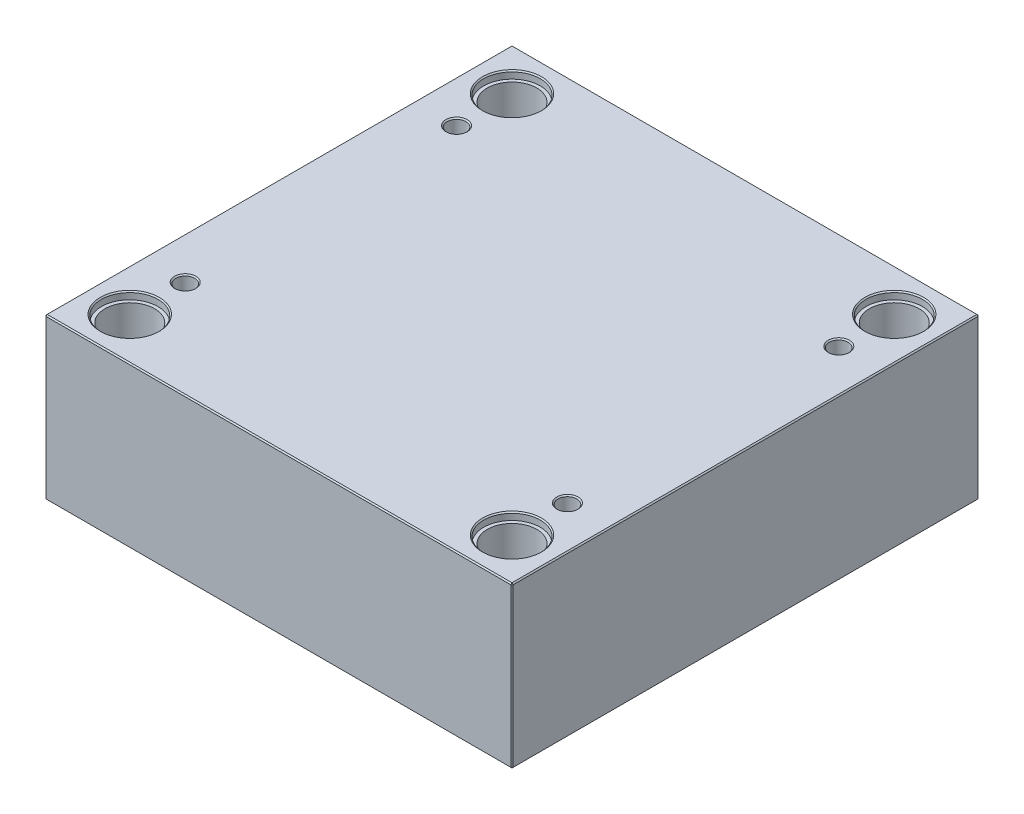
ISO-10303-21;
HEADER;
FILE_DESCRIPTION(('STEP AP214'),'2;1');
FILE_NAME('part.step','',(''),(''),'','','');
FILE_SCHEMA(('AUTOMOTIVE_DESIGN { 1 0 10303 214 1 1 1 1 }'));
ENDSEC;
DATA;
#1=APPLICATION_CONTEXT('core data for automotive mechanical design processes');
#2=APPLICATION_PROTOCOL_DEFINITION('international standard','automotive_design',2000,#1);
#3=PRODUCT_CONTEXT('',#1,'mechanical');
#4=PRODUCT('Part','Part','',(#3));
#5=PRODUCT_RELATED_PRODUCT_CATEGORY('part','',(#4));
#6=PRODUCT_DEFINITION_FORMATION('','',#4);
#7=PRODUCT_DEFINITION_CONTEXT('part definition',#1,'design');
#8=PRODUCT_DEFINITION('design','',#6,#7);
#9=PRODUCT_DEFINITION_SHAPE('','',#8);
#10=(LENGTH_UNIT() NAMED_UNIT(*) SI_UNIT(.MILLI.,.METRE.));
#11=(NAMED_UNIT(*) PLANE_ANGLE_UNIT() SI_UNIT($,.RADIAN.));
#12=(NAMED_UNIT(*) SI_UNIT($,.STERADIAN.) SOLID_ANGLE_UNIT());
#13=UNCERTAINTY_MEASURE_WITH_UNIT(LENGTH_MEASURE(1.E-05),#10,'distance_accuracy_value','');
#14=(GEOMETRIC_REPRESENTATION_CONTEXT(3) GLOBAL_UNCERTAINTY_ASSIGNED_CONTEXT((#13)) GLOBAL_UNIT_ASSIGNED_CONTEXT((#10,
#11,#12)) REPRESENTATION_CONTEXT('',''));
#15=CARTESIAN_POINT('',(0.,0.,0.));
#16=DIRECTION('',(0.,0.,1.));
#17=DIRECTION('',(1.,0.,0.));
#18=AXIS2_PLACEMENT_3D('',#15,#16,#17);
#19=CARTESIAN_POINT('',(-162.,0.,-162.));
#20=DIRECTION('',(0.,1.,0.));
#21=DIRECTION('',(0.,0.,1.));
#22=AXIS2_PLACEMENT_3D('',#19,#20,#21);
#23=CYLINDRICAL_SURFACE('',#22,21.);
#24=CARTESIAN_POINT('',(-162.,0.999999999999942,-162.));
#25=DIRECTION('',(0.,1.,0.));
#26=DIRECTION('',(0.,0.,1.));
#27=AXIS2_PLACEMENT_3D('',#24,#25,#26);
#28=CIRCLE('',#27,21.);
#29=CARTESIAN_POINT('',(-162.,0.999999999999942,-141.));
#30=VERTEX_POINT('',#29);
#31=EDGE_CURVE('E472',#30,#30,#28,.F.);
#32=ORIENTED_EDGE('',*,*,#31,.T.);
#33=EDGE_LOOP('',(#32));
#34=FACE_BOUND('',#33,.T.);
#35=CARTESIAN_POINT('',(-162.,129.7,-162.));
#36=DIRECTION('',(0.,1.,0.));
#37=DIRECTION('',(0.,0.,1.));
#38=AXIS2_PLACEMENT_3D('',#35,#36,#37);
#39=CIRCLE('',#38,21.);
#40=CARTESIAN_POINT('',(-162.,129.7,-141.));
#41=VERTEX_POINT('',#40);
#42=EDGE_CURVE('E221',#41,#41,#39,.F.);
#43=ORIENTED_EDGE('',*,*,#42,.F.);
#44=EDGE_LOOP('',(#43));
#45=FACE_BOUND('',#44,.T.);
#46=ADVANCED_FACE('F16',(#34,#45),#23,.F.);
#47=CARTESIAN_POINT('',(162.,0.,-162.));
#48=DIRECTION('',(0.,1.,0.));
#49=DIRECTION('',(0.,0.,1.));
#50=AXIS2_PLACEMENT_3D('',#47,#48,#49);
#51=CYLINDRICAL_SURFACE('',#50,21.);
#52=CARTESIAN_POINT('',(162.,0.999999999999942,-162.));
#53=DIRECTION('',(0.,1.,0.));
#54=DIRECTION('',(0.,0.,1.));
#55=AXIS2_PLACEMENT_3D('',#52,#53,#54);
#56=CIRCLE('',#55,21.);
#57=CARTESIAN_POINT('',(162.,0.999999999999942,-141.));
#58=VERTEX_POINT('',#57);
#59=EDGE_CURVE('E474',#58,#58,#56,.F.);
#60=ORIENTED_EDGE('',*,*,#59,.T.);
#61=EDGE_LOOP('',(#60));
#62=FACE_BOUND('',#61,.T.);
#63=CARTESIAN_POINT('',(162.,129.7,-162.));
#64=DIRECTION('',(0.,1.,0.));
#65=DIRECTION('',(0.,0.,1.));
#66=AXIS2_PLACEMENT_3D('',#63,#64,#65);
#67=CIRCLE('',#66,21.);
#68=CARTESIAN_POINT('',(162.,129.7,-141.));
#69=VERTEX_POINT('',#68);
#70=EDGE_CURVE('E218',#69,#69,#67,.F.);
#71=ORIENTED_EDGE('',*,*,#70,.F.);
#72=EDGE_LOOP('',(#71));
#73=FACE_BOUND('',#72,.T.);
#74=ADVANCED_FACE('F263',(#62,#73),#51,.F.);
#75=CARTESIAN_POINT('',(162.,0.,162.));
#76=DIRECTION('',(0.,1.,0.));
#77=DIRECTION('',(0.,0.,1.));
#78=AXIS2_PLACEMENT_3D('',#75,#76,#77);
#79=CYLINDRICAL_SURFACE('',#78,21.);
#80=CARTESIAN_POINT('',(162.,0.999999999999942,162.));
#81=DIRECTION('',(0.,1.,0.));
#82=DIRECTION('',(0.,0.,1.));
#83=AXIS2_PLACEMENT_3D('',#80,#81,#82);
#84=CIRCLE('',#83,21.);
#85=CARTESIAN_POINT('',(162.,0.999999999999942,183.));
#86=VERTEX_POINT('',#85);
#87=EDGE_CURVE('E477',#86,#86,#84,.F.);
#88=ORIENTED_EDGE('',*,*,#87,.T.);
#89=EDGE_LOOP('',(#88));
#90=FACE_BOUND('',#89,.T.);
#91=CARTESIAN_POINT('',(162.,129.7,162.));
#92=DIRECTION('',(0.,1.,0.));
#93=DIRECTION('',(0.,0.,1.));
#94=AXIS2_PLACEMENT_3D('',#91,#92,#93);
#95=CIRCLE('',#94,21.);
#96=CARTESIAN_POINT('',(162.,129.7,183.));
#97=VERTEX_POINT('',#96);
#98=EDGE_CURVE('E214',#97,#97,#95,.F.);
#99=ORIENTED_EDGE('',*,*,#98,.F.);
#100=EDGE_LOOP('',(#99));
#101=FACE_BOUND('',#100,.T.);
#102=ADVANCED_FACE('F270',(#90,#101),#79,.F.);
#103=CARTESIAN_POINT('',(-162.,0.,162.));
#104=DIRECTION('',(0.,1.,0.));
#105=DIRECTION('',(0.,0.,1.));
#106=AXIS2_PLACEMENT_3D('',#103,#104,#105);
#107=CYLINDRICAL_SURFACE('',#106,21.);
#108=CARTESIAN_POINT('',(-162.,0.999999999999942,162.));
#109=DIRECTION('',(0.,1.,0.));
#110=DIRECTION('',(0.,0.,1.));
#111=AXIS2_PLACEMENT_3D('',#108,#109,#110);
#112=CIRCLE('',#111,21.);
#113=CARTESIAN_POINT('',(-162.,0.999999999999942,183.));
#114=VERTEX_POINT('',#113);
#115=EDGE_CURVE('E480',#114,#114,#112,.F.);
#116=ORIENTED_EDGE('',*,*,#115,.T.);
#117=EDGE_LOOP('',(#116));
#118=FACE_BOUND('',#117,.T.);
#119=CARTESIAN_POINT('',(-162.,129.7,162.));
#120=DIRECTION('',(0.,1.,0.));
#121=DIRECTION('',(0.,0.,1.));
#122=AXIS2_PLACEMENT_3D('',#119,#120,#121);
#123=CIRCLE('',#122,21.);
#124=CARTESIAN_POINT('',(-162.,129.7,183.));
#125=VERTEX_POINT('',#124);
#126=EDGE_CURVE('E211',#125,#125,#123,.F.);
#127=ORIENTED_EDGE('',*,*,#126,.F.);
#128=EDGE_LOOP('',(#127));
#129=FACE_BOUND('',#128,.T.);
#130=ADVANCED_FACE('F277',(#118,#129),#107,.F.);
#131=CARTESIAN_POINT('',(-198.,136.,198.));
#132=DIRECTION('',(1.,0.,0.));
#133=DIRECTION('',(0.,0.,-1.));
#134=AXIS2_PLACEMENT_3D('',#131,#132,#133);
#135=PLANE('',#134);
#136=DIRECTION('',(0.,-1.,0.));
#137=VECTOR('',#136,1.);
#138=CARTESIAN_POINT('',(-198.,136.,-197.));
#139=LINE('',#138,#137);
#140=CARTESIAN_POINT('',(-198.,135.,-197.));
#141=VERTEX_POINT('',#140);
#142=CARTESIAN_POINT('',(-198.,1.,-197.));
#143=VERTEX_POINT('',#142);
#144=EDGE_CURVE('E487',#141,#143,#139,.T.);
#145=ORIENTED_EDGE('',*,*,#144,.T.);
#146=DIRECTION('',(0.,0.,1.));
#147=VECTOR('',#146,1.);
#148=CARTESIAN_POINT('',(-198.,1.,198.));
#149=LINE('',#148,#147);
#150=CARTESIAN_POINT('',(-198.,1.,197.));
#151=VERTEX_POINT('',#150);
#152=EDGE_CURVE('E490',#143,#151,#149,.T.);
#153=ORIENTED_EDGE('',*,*,#152,.T.);
#154=DIRECTION('',(0.,1.,0.));
#155=VECTOR('',#154,1.);
#156=CARTESIAN_POINT('',(-198.,136.,197.));
#157=LINE('',#156,#155);
#158=CARTESIAN_POINT('',(-198.,135.,197.));
#159=VERTEX_POINT('',#158);
#160=EDGE_CURVE('E485',#151,#159,#157,.T.);
#161=ORIENTED_EDGE('',*,*,#160,.T.);
#162=DIRECTION('',(0.,0.,-1.));
#163=VECTOR('',#162,1.);
#164=CARTESIAN_POINT('',(-198.,135.,-198.));
#165=LINE('',#164,#163);
#166=EDGE_CURVE('E483',#159,#141,#165,.T.);
#167=ORIENTED_EDGE('',*,*,#166,.T.);
#168=EDGE_LOOP('',(#145,#153,#161,#167));
#169=FACE_BOUND('',#168,.T.);
#170=ADVANCED_FACE('F298',(#169),#135,.F.);
#171=CARTESIAN_POINT('',(198.,136.,198.));
#172=DIRECTION('',(0.,0.,-1.));
#173=DIRECTION('',(-1.,0.,0.));
#174=AXIS2_PLACEMENT_3D('',#171,#172,#173);
#175=PLANE('',#174);
#176=DIRECTION('',(-1.,0.,0.));
#177=VECTOR('',#176,1.);
#178=CARTESIAN_POINT('',(-198.,135.,198.));
#179=LINE('',#178,#177);
#180=CARTESIAN_POINT('',(197.,135.,198.));
#181=VERTEX_POINT('',#180);
#182=CARTESIAN_POINT('',(-197.,135.,198.));
#183=VERTEX_POINT('',#182);
#184=EDGE_CURVE('E509',#181,#183,#179,.T.);
#185=ORIENTED_EDGE('',*,*,#184,.T.);
#186=DIRECTION('',(0.,-1.,0.));
#187=VECTOR('',#186,1.);
#188=CARTESIAN_POINT('',(-197.,136.,198.));
#189=LINE('',#188,#187);
#190=CARTESIAN_POINT('',(-197.,1.00000000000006,198.));
#191=VERTEX_POINT('',#190);
#192=EDGE_CURVE('E515',#183,#191,#189,.T.);
#193=ORIENTED_EDGE('',*,*,#192,.T.);
#194=DIRECTION('',(1.,0.,0.));
#195=VECTOR('',#194,1.);
#196=CARTESIAN_POINT('',(198.,1.00000000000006,198.));
#197=LINE('',#196,#195);
#198=CARTESIAN_POINT('',(197.,1.00000000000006,198.));
#199=VERTEX_POINT('',#198);
#200=EDGE_CURVE('E513',#191,#199,#197,.T.);
#201=ORIENTED_EDGE('',*,*,#200,.T.);
#202=DIRECTION('',(0.,1.,0.));
#203=VECTOR('',#202,1.);
#204=CARTESIAN_POINT('',(197.,136.,198.));
#205=LINE('',#204,#203);
#206=EDGE_CURVE('E511',#199,#181,#205,.T.);
#207=ORIENTED_EDGE('',*,*,#206,.T.);
#208=EDGE_LOOP('',(#185,#193,#201,#207));
#209=FACE_BOUND('',#208,.T.);
#210=ADVANCED_FACE('F294',(#209),#175,.F.);
#211=CARTESIAN_POINT('',(198.,136.,198.));
#212=DIRECTION('',(-1.,0.,0.));
#213=DIRECTION('',(0.,0.,1.));
#214=AXIS2_PLACEMENT_3D('',#211,#212,#213);
#215=PLANE('',#214);
#216=DIRECTION('',(0.,0.,-1.));
#217=VECTOR('',#216,1.);
#218=CARTESIAN_POINT('',(198.,1.00000000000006,198.));
#219=LINE('',#218,#217);
#220=CARTESIAN_POINT('',(198.,1.00000000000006,197.));
#221=VERTEX_POINT('',#220);
#222=CARTESIAN_POINT('',(198.,1.00000000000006,-197.));
#223=VERTEX_POINT('',#222);
#224=EDGE_CURVE('E504',#221,#223,#219,.T.);
#225=ORIENTED_EDGE('',*,*,#224,.T.);
#226=DIRECTION('',(0.,1.,0.));
#227=VECTOR('',#226,1.);
#228=CARTESIAN_POINT('',(198.,136.,-197.));
#229=LINE('',#228,#227);
#230=CARTESIAN_POINT('',(198.,135.,-197.));
#231=VERTEX_POINT('',#230);
#232=EDGE_CURVE('E506',#223,#231,#229,.T.);
#233=ORIENTED_EDGE('',*,*,#232,.T.);
#234=DIRECTION('',(0.,0.,1.));
#235=VECTOR('',#234,1.);
#236=CARTESIAN_POINT('',(198.,135.,198.));
#237=LINE('',#236,#235);
#238=CARTESIAN_POINT('',(198.,135.,197.));
#239=VERTEX_POINT('',#238);
#240=EDGE_CURVE('E500',#231,#239,#237,.T.);
#241=ORIENTED_EDGE('',*,*,#240,.T.);
#242=DIRECTION('',(0.,-1.,0.));
#243=VECTOR('',#242,1.);
#244=CARTESIAN_POINT('',(198.,136.,197.));
#245=LINE('',#244,#243);
#246=EDGE_CURVE('E502',#239,#221,#245,.T.);
#247=ORIENTED_EDGE('',*,*,#246,.T.);
#248=EDGE_LOOP('',(#225,#233,#241,#247));
#249=FACE_BOUND('',#248,.T.);
#250=ADVANCED_FACE('F290',(#249),#215,.F.);
#251=CARTESIAN_POINT('',(198.,136.,-198.));
#252=DIRECTION('',(0.,0.,1.));
#253=DIRECTION('',(1.,0.,0.));
#254=AXIS2_PLACEMENT_3D('',#251,#252,#253);
#255=PLANE('',#254);
#256=DIRECTION('',(0.,-1.,0.));
#257=VECTOR('',#256,1.);
#258=CARTESIAN_POINT('',(197.,136.,-198.));
#259=LINE('',#258,#257);
#260=CARTESIAN_POINT('',(197.,135.,-198.));
#261=VERTEX_POINT('',#260);
#262=CARTESIAN_POINT('',(197.,1.00000000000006,-198.));
#263=VERTEX_POINT('',#262);
#264=EDGE_CURVE('E494',#261,#263,#259,.T.);
#265=ORIENTED_EDGE('',*,*,#264,.T.);
#266=DIRECTION('',(-1.,0.,0.));
#267=VECTOR('',#266,1.);
#268=CARTESIAN_POINT('',(198.,1.00000000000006,-198.));
#269=LINE('',#268,#267);
#270=CARTESIAN_POINT('',(-197.,1.00000000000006,-198.));
#271=VERTEX_POINT('',#270);
#272=EDGE_CURVE('E138',#263,#271,#269,.T.);
#273=ORIENTED_EDGE('',*,*,#272,.T.);
#274=DIRECTION('',(0.,1.,0.));
#275=VECTOR('',#274,1.);
#276=CARTESIAN_POINT('',(-197.,136.,-198.));
#277=LINE('',#276,#275);
#278=CARTESIAN_POINT('',(-197.,135.,-198.));
#279=VERTEX_POINT('',#278);
#280=EDGE_CURVE('E496',#271,#279,#277,.T.);
#281=ORIENTED_EDGE('',*,*,#280,.T.);
#282=DIRECTION('',(1.,0.,0.));
#283=VECTOR('',#282,1.);
#284=CARTESIAN_POINT('',(198.,135.,-198.));
#285=LINE('',#284,#283);
#286=EDGE_CURVE('E492',#279,#261,#285,.T.);
#287=ORIENTED_EDGE('',*,*,#286,.T.);
#288=EDGE_LOOP('',(#265,#273,#281,#287));
#289=FACE_BOUND('',#288,.T.);
#290=ADVANCED_FACE('F282',(#289),#255,.F.);
#291=CARTESIAN_POINT('',(0.,136.,0.));
#292=DIRECTION('',(0.,1.,0.));
#293=DIRECTION('',(0.,0.,1.));
#294=AXIS2_PLACEMENT_3D('',#291,#292,#293);
#295=PLANE('',#294);
#296=CARTESIAN_POINT('',(162.,136.,162.));
#297=DIRECTION('',(0.,1.,0.));
#298=DIRECTION('',(0.,0.,1.));
#299=AXIS2_PLACEMENT_3D('',#296,#297,#298);
#300=CIRCLE('',#299,25.);
#301=CARTESIAN_POINT('',(162.,136.,187.));
#302=VERTEX_POINT('',#301);
#303=EDGE_CURVE('E236',#302,#302,#300,.F.);
#304=ORIENTED_EDGE('',*,*,#303,.T.);
#305=EDGE_LOOP('',(#304));
#306=FACE_BOUND('',#305,.T.);
#307=CARTESIAN_POINT('',(-162.,136.,162.));
#308=DIRECTION('',(0.,1.,0.));
#309=DIRECTION('',(0.,0.,1.));
#310=AXIS2_PLACEMENT_3D('',#307,#308,#309);
#311=CIRCLE('',#310,25.);
#312=CARTESIAN_POINT('',(-162.,136.,187.));
#313=VERTEX_POINT('',#312);
#314=EDGE_CURVE('E233',#313,#313,#311,.F.);
#315=ORIENTED_EDGE('',*,*,#314,.T.);
#316=EDGE_LOOP('',(#315));
#317=FACE_BOUND('',#316,.T.);
#318=CARTESIAN_POINT('',(162.,136.,-162.));
#319=DIRECTION('',(0.,1.,0.));
#320=DIRECTION('',(0.,0.,1.));
#321=AXIS2_PLACEMENT_3D('',#318,#319,#320);
#322=CIRCLE('',#321,25.);
#323=CARTESIAN_POINT('',(162.,136.,-137.));
#324=VERTEX_POINT('',#323);
#325=EDGE_CURVE('E230',#324,#324,#322,.F.);
#326=ORIENTED_EDGE('',*,*,#325,.T.);
#327=EDGE_LOOP('',(#326));
#328=FACE_BOUND('',#327,.T.);
#329=CARTESIAN_POINT('',(-162.,136.,-162.));
#330=DIRECTION('',(0.,1.,0.));
#331=DIRECTION('',(0.,0.,1.));
#332=AXIS2_PLACEMENT_3D('',#329,#330,#331);
#333=CIRCLE('',#332,25.);
#334=CARTESIAN_POINT('',(-162.,136.,-137.));
#335=VERTEX_POINT('',#334);
#336=EDGE_CURVE('E227',#335,#335,#333,.F.);
#337=ORIENTED_EDGE('',*,*,#336,.T.);
#338=EDGE_LOOP('',(#337));
#339=FACE_BOUND('',#338,.T.);
#340=CARTESIAN_POINT('',(-162.,136.,115.));
#341=DIRECTION('',(0.,1.,0.));
#342=DIRECTION('',(0.,0.,1.));
#343=AXIS2_PLACEMENT_3D('',#340,#341,#342);
#344=CIRCLE('',#343,9.);
#345=CARTESIAN_POINT('',(-162.,136.,124.));
#346=VERTEX_POINT('',#345);
#347=EDGE_CURVE('E198',#346,#346,#344,.F.);
#348=ORIENTED_EDGE('',*,*,#347,.T.);
#349=EDGE_LOOP('',(#348));
#350=FACE_BOUND('',#349,.T.);
#351=CARTESIAN_POINT('',(162.,136.,115.));
#352=DIRECTION('',(0.,1.,0.));
#353=DIRECTION('',(0.,0.,1.));
#354=AXIS2_PLACEMENT_3D('',#351,#352,#353);
#355=CIRCLE('',#354,9.);
#356=CARTESIAN_POINT('',(162.,136.,124.));
#357=VERTEX_POINT('',#356);
#358=EDGE_CURVE('E195',#357,#357,#355,.F.);
#359=ORIENTED_EDGE('',*,*,#358,.T.);
#360=EDGE_LOOP('',(#359));
#361=FACE_BOUND('',#360,.T.);
#362=CARTESIAN_POINT('',(162.,136.,-115.));
#363=DIRECTION('',(0.,1.,0.));
#364=DIRECTION('',(0.,0.,1.));
#365=AXIS2_PLACEMENT_3D('',#362,#363,#364);
#366=CIRCLE('',#365,9.);
#367=CARTESIAN_POINT('',(162.,136.,-106.));
#368=VERTEX_POINT('',#367);
#369=EDGE_CURVE('E192',#368,#368,#366,.F.);
#370=ORIENTED_EDGE('',*,*,#369,.T.);
#371=EDGE_LOOP('',(#370));
#372=FACE_BOUND('',#371,.T.);
#373=CARTESIAN_POINT('',(-162.,136.,-115.));
#374=DIRECTION('',(0.,1.,0.));
#375=DIRECTION('',(0.,0.,1.));
#376=AXIS2_PLACEMENT_3D('',#373,#374,#375);
#377=CIRCLE('',#376,9.);
#378=CARTESIAN_POINT('',(-162.,136.,-106.));
#379=VERTEX_POINT('',#378);
#380=EDGE_CURVE('E188',#379,#379,#377,.F.);
#381=ORIENTED_EDGE('',*,*,#380,.T.);
#382=EDGE_LOOP('',(#381));
#383=FACE_BOUND('',#382,.T.);
#384=DIRECTION('',(0.,0.,-1.));
#385=VECTOR('',#384,1.);
#386=CARTESIAN_POINT('',(197.,136.,-198.));
#387=LINE('',#386,#385);
#388=CARTESIAN_POINT('',(197.,136.,197.));
#389=VERTEX_POINT('',#388);
#390=CARTESIAN_POINT('',(197.,136.,-197.));
#391=VERTEX_POINT('',#390);
#392=EDGE_CURVE('E31',#389,#391,#387,.T.);
#393=ORIENTED_EDGE('',*,*,#392,.T.);
#394=DIRECTION('',(-1.,0.,0.));
#395=VECTOR('',#394,1.);
#396=CARTESIAN_POINT('',(-198.,136.,-197.));
#397=LINE('',#396,#395);
#398=CARTESIAN_POINT('',(-197.,136.,-197.));
#399=VERTEX_POINT('',#398);
#400=EDGE_CURVE('E189',#391,#399,#397,.T.);
#401=ORIENTED_EDGE('',*,*,#400,.T.);
#402=DIRECTION('',(0.,0.,1.));
#403=VECTOR('',#402,1.);
#404=CARTESIAN_POINT('',(-197.,136.,198.));
#405=LINE('',#404,#403);
#406=CARTESIAN_POINT('',(-197.,136.,197.));
#407=VERTEX_POINT('',#406);
#408=EDGE_CURVE('E518',#399,#407,#405,.T.);
#409=ORIENTED_EDGE('',*,*,#408,.T.);
#410=DIRECTION('',(1.,0.,0.));
#411=VECTOR('',#410,1.);
#412=CARTESIAN_POINT('',(198.,136.,197.));
#413=LINE('',#412,#411);
#414=EDGE_CURVE('E36',#407,#389,#413,.T.);
#415=ORIENTED_EDGE('',*,*,#414,.T.);
#416=EDGE_LOOP('',(#393,#401,#409,#415));
#417=FACE_BOUND('',#416,.T.);
#418=ADVANCED_FACE('F279',(#306,#317,#328,#339,#350,#361,#372,#383,#417),#295,.T.);
#419=CARTESIAN_POINT('',(0.,0.,0.));
#420=DIRECTION('',(0.,1.,0.));
#421=DIRECTION('',(0.,0.,1.));
#422=AXIS2_PLACEMENT_3D('',#419,#420,#421);
#423=PLANE('',#422);
#424=CARTESIAN_POINT('',(-162.,0.,-162.));
#425=DIRECTION('',(0.,1.,0.));
#426=DIRECTION('',(0.,0.,1.));
#427=AXIS2_PLACEMENT_3D('',#424,#425,#426);
#428=CIRCLE('',#427,22.);
#429=CARTESIAN_POINT('',(-162.,0.,-140.));
#430=VERTEX_POINT('',#429);
#431=EDGE_CURVE('E469',#430,#430,#428,.T.);
#432=ORIENTED_EDGE('',*,*,#431,.T.);
#433=EDGE_LOOP('',(#432));
#434=FACE_BOUND('',#433,.T.);
#435=CARTESIAN_POINT('',(162.,0.,-162.));
#436=DIRECTION('',(0.,1.,0.));
#437=DIRECTION('',(0.,0.,1.));
#438=AXIS2_PLACEMENT_3D('',#435,#436,#437);
#439=CIRCLE('',#438,22.);
#440=CARTESIAN_POINT('',(162.,0.,-140.));
#441=VERTEX_POINT('',#440);
#442=EDGE_CURVE('E466',#441,#441,#439,.T.);
#443=ORIENTED_EDGE('',*,*,#442,.T.);
#444=EDGE_LOOP('',(#443));
#445=FACE_BOUND('',#444,.T.);
#446=CARTESIAN_POINT('',(162.,0.,162.));
#447=DIRECTION('',(0.,1.,0.));
#448=DIRECTION('',(0.,0.,1.));
#449=AXIS2_PLACEMENT_3D('',#446,#447,#448);
#450=CIRCLE('',#449,22.);
#451=CARTESIAN_POINT('',(162.,0.,184.));
#452=VERTEX_POINT('',#451);
#453=EDGE_CURVE('E463',#452,#452,#450,.T.);
#454=ORIENTED_EDGE('',*,*,#453,.T.);
#455=EDGE_LOOP('',(#454));
#456=FACE_BOUND('',#455,.T.);
#457=CARTESIAN_POINT('',(-162.,0.,162.));
#458=DIRECTION('',(0.,1.,0.));
#459=DIRECTION('',(0.,0.,1.));
#460=AXIS2_PLACEMENT_3D('',#457,#458,#459);
#461=CIRCLE('',#460,22.);
#462=CARTESIAN_POINT('',(-162.,0.,184.));
#463=VERTEX_POINT('',#462);
#464=EDGE_CURVE('E460',#463,#463,#461,.T.);
#465=ORIENTED_EDGE('',*,*,#464,.T.);
#466=EDGE_LOOP('',(#465));
#467=FACE_BOUND('',#466,.T.);
#468=DIRECTION('',(0.,0.,1.));
#469=VECTOR('',#468,1.);
#470=CARTESIAN_POINT('',(197.,0.,0.));
#471=LINE('',#470,#469);
#472=CARTESIAN_POINT('',(197.,0.,-197.));
#473=VERTEX_POINT('',#472);
#474=CARTESIAN_POINT('',(197.,0.,197.));
#475=VERTEX_POINT('',#474);
#476=EDGE_CURVE('E108',#473,#475,#471,.T.);
#477=ORIENTED_EDGE('',*,*,#476,.T.);
#478=DIRECTION('',(-1.,0.,0.));
#479=VECTOR('',#478,1.);
#480=CARTESIAN_POINT('',(0.,0.,197.));
#481=LINE('',#480,#479);
#482=CARTESIAN_POINT('',(-197.,0.,197.));
#483=VERTEX_POINT('',#482);
#484=EDGE_CURVE('E458',#475,#483,#481,.T.);
#485=ORIENTED_EDGE('',*,*,#484,.T.);
#486=DIRECTION('',(0.,0.,-1.));
#487=VECTOR('',#486,1.);
#488=CARTESIAN_POINT('',(-197.,0.,0.));
#489=LINE('',#488,#487);
#490=CARTESIAN_POINT('',(-197.,0.,-197.));
#491=VERTEX_POINT('',#490);
#492=EDGE_CURVE('E110',#483,#491,#489,.T.);
#493=ORIENTED_EDGE('',*,*,#492,.T.);
#494=DIRECTION('',(1.,0.,0.));
#495=VECTOR('',#494,1.);
#496=CARTESIAN_POINT('',(0.,0.,-197.));
#497=LINE('',#496,#495);
#498=EDGE_CURVE('E104',#491,#473,#497,.T.);
#499=ORIENTED_EDGE('',*,*,#498,.T.);
#500=EDGE_LOOP('',(#477,#485,#493,#499));
#501=FACE_BOUND('',#500,.T.);
#502=ADVANCED_FACE('F106',(#434,#445,#456,#467,#501),#423,.F.);
#503=CARTESIAN_POINT('',(-162.,0.,-162.));
#504=DIRECTION('',(0.,-1.,0.));
#505=DIRECTION('',(0.,0.,-1.));
#506=AXIS2_PLACEMENT_3D('',#503,#504,#505);
#507=CONICAL_SURFACE('',#506,22.,0.785398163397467);
#508=ORIENTED_EDGE('',*,*,#31,.F.);
#509=EDGE_LOOP('',(#508));
#510=FACE_BOUND('',#509,.T.);
#511=ORIENTED_EDGE('',*,*,#431,.F.);
#512=EDGE_LOOP('',(#511));
#513=FACE_BOUND('',#512,.T.);
#514=ADVANCED_FACE('F286',(#510,#513),#507,.F.);
#515=CARTESIAN_POINT('',(162.,0.,-162.));
#516=DIRECTION('',(0.,-1.,0.));
#517=DIRECTION('',(0.,0.,-1.));
#518=AXIS2_PLACEMENT_3D('',#515,#516,#517);
#519=CONICAL_SURFACE('',#518,22.,0.785398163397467);
#520=ORIENTED_EDGE('',*,*,#59,.F.);
#521=EDGE_LOOP('',(#520));
#522=FACE_BOUND('',#521,.T.);
#523=ORIENTED_EDGE('',*,*,#442,.F.);
#524=EDGE_LOOP('',(#523));
#525=FACE_BOUND('',#524,.T.);
#526=ADVANCED_FACE('F305',(#522,#525),#519,.F.);
#527=CARTESIAN_POINT('',(162.,0.,162.));
#528=DIRECTION('',(0.,-1.,0.));
#529=DIRECTION('',(0.,0.,-1.));
#530=AXIS2_PLACEMENT_3D('',#527,#528,#529);
#531=CONICAL_SURFACE('',#530,22.,0.785398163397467);
#532=ORIENTED_EDGE('',*,*,#87,.F.);
#533=EDGE_LOOP('',(#532));
#534=FACE_BOUND('',#533,.T.);
#535=ORIENTED_EDGE('',*,*,#453,.F.);
#536=EDGE_LOOP('',(#535));
#537=FACE_BOUND('',#536,.T.);
#538=ADVANCED_FACE('F309',(#534,#537),#531,.F.);
#539=CARTESIAN_POINT('',(-162.,0.,162.));
#540=DIRECTION('',(0.,-1.,0.));
#541=DIRECTION('',(0.,0.,-1.));
#542=AXIS2_PLACEMENT_3D('',#539,#540,#541);
#543=CONICAL_SURFACE('',#542,22.,0.785398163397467);
#544=ORIENTED_EDGE('',*,*,#115,.F.);
#545=EDGE_LOOP('',(#544));
#546=FACE_BOUND('',#545,.T.);
#547=ORIENTED_EDGE('',*,*,#464,.F.);
#548=EDGE_LOOP('',(#547));
#549=FACE_BOUND('',#548,.T.);
#550=ADVANCED_FACE('F313',(#546,#549),#543,.F.);
#551=CARTESIAN_POINT('',(198.,136.,197.));
#552=DIRECTION('',(-0.707106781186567,0.,-0.707106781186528));
#553=DIRECTION('',(0.,-1.,0.));
#554=AXIS2_PLACEMENT_3D('',#551,#552,#553);
#555=PLANE('',#554);
#556=DIRECTION('',(-0.707106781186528,0.,0.707106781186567));
#557=VECTOR('',#556,1.);
#558=CARTESIAN_POINT('',(197.,135.,198.));
#559=LINE('',#558,#557);
#560=EDGE_CURVE('E126',#181,#239,#559,.F.);
#561=ORIENTED_EDGE('',*,*,#560,.F.);
#562=ORIENTED_EDGE('',*,*,#206,.F.);
#563=DIRECTION('',(0.707106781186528,0.,-0.707106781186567));
#564=VECTOR('',#563,1.);
#565=CARTESIAN_POINT('',(197.,1.00000000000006,198.));
#566=LINE('',#565,#564);
#567=EDGE_CURVE('E180',#221,#199,#566,.F.);
#568=ORIENTED_EDGE('',*,*,#567,.F.);
#569=ORIENTED_EDGE('',*,*,#246,.F.);
#570=EDGE_LOOP('',(#561,#562,#568,#569));
#571=FACE_BOUND('',#570,.T.);
#572=ADVANCED_FACE('F317',(#571),#555,.F.);
#573=CARTESIAN_POINT('',(197.,135.,198.));
#574=DIRECTION('',(0.577350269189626,0.577350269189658,0.577350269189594));
#575=DIRECTION('',(-0.707106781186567,0.707106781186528,0.));
#576=AXIS2_PLACEMENT_3D('',#573,#574,#575);
#577=PLANE('',#576);
#578=DIRECTION('',(0.,-0.707106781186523,0.707106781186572));
#579=VECTOR('',#578,1.);
#580=CARTESIAN_POINT('',(197.,135.,198.));
#581=LINE('',#580,#579);
#582=EDGE_CURVE('E175',#181,#389,#581,.F.);
#583=ORIENTED_EDGE('',*,*,#582,.F.);
#584=ORIENTED_EDGE('',*,*,#560,.T.);
#585=DIRECTION('',(-0.707106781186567,0.707106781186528,0.));
#586=VECTOR('',#585,1.);
#587=CARTESIAN_POINT('',(197.5,135.5,197.));
#588=LINE('',#587,#586);
#589=EDGE_CURVE('E177',#389,#239,#588,.F.);
#590=ORIENTED_EDGE('',*,*,#589,.F.);
#591=EDGE_LOOP('',(#583,#584,#590));
#592=FACE_BOUND('',#591,.T.);
#593=ADVANCED_FACE('F385',(#592),#577,.T.);
#594=CARTESIAN_POINT('',(197.,1.00000000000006,198.));
#595=DIRECTION('',(0.577350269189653,-0.577350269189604,0.57735026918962));
#596=DIRECTION('',(0.707106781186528,0.,-0.707106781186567));
#597=AXIS2_PLACEMENT_3D('',#594,#595,#596);
#598=PLANE('',#597);
#599=DIRECTION('',(-0.707106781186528,-0.707106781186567,0.));
#600=VECTOR('',#599,1.);
#601=CARTESIAN_POINT('',(197.5,0.500000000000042,197.));
#602=LINE('',#601,#600);
#603=EDGE_CURVE('E124',#221,#475,#602,.T.);
#604=ORIENTED_EDGE('',*,*,#603,.F.);
#605=ORIENTED_EDGE('',*,*,#567,.T.);
#606=DIRECTION('',(0.,0.707106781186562,0.707106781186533));
#607=VECTOR('',#606,1.);
#608=CARTESIAN_POINT('',(197.,1.00000000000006,198.));
#609=LINE('',#608,#607);
#610=EDGE_CURVE('E172',#475,#199,#609,.T.);
#611=ORIENTED_EDGE('',*,*,#610,.F.);
#612=EDGE_LOOP('',(#604,#605,#611));
#613=FACE_BOUND('',#612,.T.);
#614=ADVANCED_FACE('F381',(#613),#598,.T.);
#615=CARTESIAN_POINT('',(197.,136.,0.));
#616=DIRECTION('',(0.707106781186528,0.707106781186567,0.));
#617=DIRECTION('',(0.,0.,1.));
#618=AXIS2_PLACEMENT_3D('',#615,#616,#617);
#619=PLANE('',#618);
#620=ORIENTED_EDGE('',*,*,#589,.T.);
#621=ORIENTED_EDGE('',*,*,#240,.F.);
#622=DIRECTION('',(0.707106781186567,-0.707106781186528,0.));
#623=VECTOR('',#622,1.);
#624=CARTESIAN_POINT('',(198.,135.,-197.));
#625=LINE('',#624,#623);
#626=EDGE_CURVE('E166',#391,#231,#625,.T.);
#627=ORIENTED_EDGE('',*,*,#626,.F.);
#628=ORIENTED_EDGE('',*,*,#392,.F.);
#629=EDGE_LOOP('',(#620,#621,#627,#628));
#630=FACE_BOUND('',#629,.T.);
#631=ADVANCED_FACE('F377',(#630),#619,.T.);
#632=CARTESIAN_POINT('',(0.,136.,197.));
#633=DIRECTION('',(0.,0.707106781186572,0.707106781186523));
#634=DIRECTION('',(-1.,0.,0.));
#635=AXIS2_PLACEMENT_3D('',#632,#633,#634);
#636=PLANE('',#635);
#637=ORIENTED_EDGE('',*,*,#582,.T.);
#638=ORIENTED_EDGE('',*,*,#414,.F.);
#639=DIRECTION('',(0.,0.707106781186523,-0.707106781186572));
#640=VECTOR('',#639,1.);
#641=CARTESIAN_POINT('',(-197.,135.5,197.5));
#642=LINE('',#641,#640);
#643=EDGE_CURVE('E163',#183,#407,#642,.T.);
#644=ORIENTED_EDGE('',*,*,#643,.F.);
#645=ORIENTED_EDGE('',*,*,#184,.F.);
#646=EDGE_LOOP('',(#637,#638,#644,#645));
#647=FACE_BOUND('',#646,.T.);
#648=ADVANCED_FACE('F373',(#647),#636,.T.);
#649=CARTESIAN_POINT('',(-197.,136.,198.));
#650=DIRECTION('',(0.707106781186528,0.,-0.707106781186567));
#651=DIRECTION('',(0.,-1.,0.));
#652=AXIS2_PLACEMENT_3D('',#649,#650,#651);
#653=PLANE('',#652);
#654=DIRECTION('',(0.707106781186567,0.,0.707106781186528));
#655=VECTOR('',#654,1.);
#656=CARTESIAN_POINT('',(-197.,1.00000000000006,198.));
#657=LINE('',#656,#655);
#658=EDGE_CURVE('E157',#191,#151,#657,.F.);
#659=ORIENTED_EDGE('',*,*,#658,.F.);
#660=ORIENTED_EDGE('',*,*,#192,.F.);
#661=DIRECTION('',(-0.707106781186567,0.,-0.707106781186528));
#662=VECTOR('',#661,1.);
#663=CARTESIAN_POINT('',(-198.,135.,197.));
#664=LINE('',#663,#662);
#665=EDGE_CURVE('E160',#159,#183,#664,.F.);
#666=ORIENTED_EDGE('',*,*,#665,.F.);
#667=ORIENTED_EDGE('',*,*,#160,.F.);
#668=EDGE_LOOP('',(#659,#660,#666,#667));
#669=FACE_BOUND('',#668,.T.);
#670=ADVANCED_FACE('F369',(#669),#653,.F.);
#671=CARTESIAN_POINT('',(198.,1.00000000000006,198.));
#672=DIRECTION('',(0.,0.707106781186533,-0.707106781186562));
#673=DIRECTION('',(1.,0.,0.));
#674=AXIS2_PLACEMENT_3D('',#671,#672,#673);
#675=PLANE('',#674);
#676=ORIENTED_EDGE('',*,*,#610,.T.);
#677=ORIENTED_EDGE('',*,*,#200,.F.);
#678=DIRECTION('',(0.,-0.707106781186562,-0.707106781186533));
#679=VECTOR('',#678,1.);
#680=CARTESIAN_POINT('',(-197.,1.00000000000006,198.));
#681=LINE('',#680,#679);
#682=EDGE_CURVE('E135',#483,#191,#681,.F.);
#683=ORIENTED_EDGE('',*,*,#682,.F.);
#684=ORIENTED_EDGE('',*,*,#484,.F.);
#685=EDGE_LOOP('',(#676,#677,#683,#684));
#686=FACE_BOUND('',#685,.T.);
#687=ADVANCED_FACE('F366',(#686),#675,.F.);
#688=CARTESIAN_POINT('',(198.,1.00000000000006,198.));
#689=DIRECTION('',(-0.707106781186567,0.707106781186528,0.));
#690=DIRECTION('',(0.,0.,-1.));
#691=AXIS2_PLACEMENT_3D('',#688,#689,#690);
#692=PLANE('',#691);
#693=ORIENTED_EDGE('',*,*,#603,.T.);
#694=ORIENTED_EDGE('',*,*,#476,.F.);
#695=DIRECTION('',(0.707106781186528,0.707106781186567,0.));
#696=VECTOR('',#695,1.);
#697=CARTESIAN_POINT('',(197.5,0.500000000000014,-197.));
#698=LINE('',#697,#696);
#699=EDGE_CURVE('E121',#223,#473,#698,.F.);
#700=ORIENTED_EDGE('',*,*,#699,.F.);
#701=ORIENTED_EDGE('',*,*,#224,.F.);
#702=EDGE_LOOP('',(#693,#694,#700,#701));
#703=FACE_BOUND('',#702,.T.);
#704=ADVANCED_FACE('F119',(#703),#692,.F.);
#705=CARTESIAN_POINT('',(197.,136.,-198.));
#706=DIRECTION('',(-0.707106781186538,0.,0.707106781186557));
#707=DIRECTION('',(0.,-1.,0.));
#708=AXIS2_PLACEMENT_3D('',#705,#706,#707);
#709=PLANE('',#708);
#710=DIRECTION('',(0.707106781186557,0.,0.707106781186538));
#711=VECTOR('',#710,1.);
#712=CARTESIAN_POINT('',(198.,135.,-197.));
#713=LINE('',#712,#711);
#714=EDGE_CURVE('E168',#231,#261,#713,.F.);
#715=ORIENTED_EDGE('',*,*,#714,.F.);
#716=ORIENTED_EDGE('',*,*,#232,.F.);
#717=DIRECTION('',(-0.707106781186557,0.,-0.707106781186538));
#718=VECTOR('',#717,1.);
#719=CARTESIAN_POINT('',(197.,1.00000000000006,-198.));
#720=LINE('',#719,#718);
#721=EDGE_CURVE('E134',#263,#223,#720,.F.);
#722=ORIENTED_EDGE('',*,*,#721,.F.);
#723=ORIENTED_EDGE('',*,*,#264,.F.);
#724=EDGE_LOOP('',(#715,#716,#722,#723));
#725=FACE_BOUND('',#724,.T.);
#726=ADVANCED_FACE('F359',(#725),#709,.F.);
#727=CARTESIAN_POINT('',(198.,135.,-197.));
#728=DIRECTION('',(0.577350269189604,0.577350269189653,-0.57735026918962));
#729=DIRECTION('',(0.,0.707106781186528,0.707106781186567));
#730=AXIS2_PLACEMENT_3D('',#727,#728,#729);
#731=PLANE('',#730);
#732=ORIENTED_EDGE('',*,*,#626,.T.);
#733=ORIENTED_EDGE('',*,*,#714,.T.);
#734=DIRECTION('',(0.,0.707106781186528,0.707106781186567));
#735=VECTOR('',#734,1.);
#736=CARTESIAN_POINT('',(197.,135.5,-197.5));
#737=LINE('',#736,#735);
#738=EDGE_CURVE('E152',#391,#261,#737,.F.);
#739=ORIENTED_EDGE('',*,*,#738,.F.);
#740=EDGE_LOOP('',(#732,#733,#739));
#741=FACE_BOUND('',#740,.T.);
#742=ADVANCED_FACE('F355',(#741),#731,.T.);
#743=CARTESIAN_POINT('',(-198.,135.,197.));
#744=DIRECTION('',(-0.577350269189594,0.577350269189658,0.577350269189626));
#745=DIRECTION('',(0.,-0.707106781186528,0.707106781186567));
#746=AXIS2_PLACEMENT_3D('',#743,#744,#745);
#747=PLANE('',#746);
#748=ORIENTED_EDGE('',*,*,#665,.T.);
#749=ORIENTED_EDGE('',*,*,#643,.T.);
#750=DIRECTION('',(-0.707106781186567,-0.707106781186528,0.));
#751=VECTOR('',#750,1.);
#752=CARTESIAN_POINT('',(-198.,135.,197.));
#753=LINE('',#752,#751);
#754=EDGE_CURVE('E143',#159,#407,#753,.F.);
#755=ORIENTED_EDGE('',*,*,#754,.F.);
#756=EDGE_LOOP('',(#748,#749,#755));
#757=FACE_BOUND('',#756,.T.);
#758=ADVANCED_FACE('F351',(#757),#747,.T.);
#759=CARTESIAN_POINT('',(-197.,1.00000000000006,198.));
#760=DIRECTION('',(-0.577350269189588,-0.577350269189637,0.577350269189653));
#761=DIRECTION('',(0.,-0.707106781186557,-0.707106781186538));
#762=AXIS2_PLACEMENT_3D('',#759,#760,#761);
#763=PLANE('',#762);
#764=ORIENTED_EDGE('',*,*,#682,.T.);
#765=ORIENTED_EDGE('',*,*,#658,.T.);
#766=DIRECTION('',(-0.707106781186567,0.707106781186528,0.));
#767=VECTOR('',#766,1.);
#768=CARTESIAN_POINT('',(-197.5,0.500000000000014,197.));
#769=LINE('',#768,#767);
#770=EDGE_CURVE('E139',#483,#151,#769,.T.);
#771=ORIENTED_EDGE('',*,*,#770,.F.);
#772=EDGE_LOOP('',(#764,#765,#771));
#773=FACE_BOUND('',#772,.T.);
#774=ADVANCED_FACE('F348',(#773),#763,.T.);
#775=CARTESIAN_POINT('',(197.,1.00000000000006,-198.));
#776=DIRECTION('',(0.577350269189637,-0.577350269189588,-0.577350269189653));
#777=DIRECTION('',(-0.707106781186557,0.,-0.707106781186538));
#778=AXIS2_PLACEMENT_3D('',#775,#776,#777);
#779=PLANE('',#778);
#780=ORIENTED_EDGE('',*,*,#721,.T.);
#781=ORIENTED_EDGE('',*,*,#699,.T.);
#782=DIRECTION('',(0.,-0.707106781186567,0.707106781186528));
#783=VECTOR('',#782,1.);
#784=CARTESIAN_POINT('',(197.,1.00000000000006,-198.));
#785=LINE('',#784,#783);
#786=EDGE_CURVE('E131',#263,#473,#785,.T.);
#787=ORIENTED_EDGE('',*,*,#786,.F.);
#788=EDGE_LOOP('',(#780,#781,#787));
#789=FACE_BOUND('',#788,.T.);
#790=ADVANCED_FACE('F130',(#789),#779,.T.);
#791=CARTESIAN_POINT('',(0.,136.,-197.));
#792=DIRECTION('',(0.,0.707106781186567,-0.707106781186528));
#793=DIRECTION('',(1.,0.,0.));
#794=AXIS2_PLACEMENT_3D('',#791,#792,#793);
#795=PLANE('',#794);
#796=ORIENTED_EDGE('',*,*,#738,.T.);
#797=ORIENTED_EDGE('',*,*,#286,.F.);
#798=DIRECTION('',(0.,-0.707106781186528,-0.707106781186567));
#799=VECTOR('',#798,1.);
#800=CARTESIAN_POINT('',(-197.,135.,-198.));
#801=LINE('',#800,#799);
#802=EDGE_CURVE('E140',#399,#279,#801,.T.);
#803=ORIENTED_EDGE('',*,*,#802,.F.);
#804=ORIENTED_EDGE('',*,*,#400,.F.);
#805=EDGE_LOOP('',(#796,#797,#803,#804));
#806=FACE_BOUND('',#805,.T.);
#807=ADVANCED_FACE('F341',(#806),#795,.T.);
#808=CARTESIAN_POINT('',(-197.,136.,0.));
#809=DIRECTION('',(-0.707106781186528,0.707106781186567,0.));
#810=DIRECTION('',(0.,0.,-1.));
#811=AXIS2_PLACEMENT_3D('',#808,#809,#810);
#812=PLANE('',#811);
#813=ORIENTED_EDGE('',*,*,#754,.T.);
#814=ORIENTED_EDGE('',*,*,#408,.F.);
#815=DIRECTION('',(0.707106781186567,0.707106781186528,0.));
#816=VECTOR('',#815,1.);
#817=CARTESIAN_POINT('',(-197.5,135.5,-197.));
#818=LINE('',#817,#816);
#819=EDGE_CURVE('E146',#141,#399,#818,.T.);
#820=ORIENTED_EDGE('',*,*,#819,.F.);
#821=ORIENTED_EDGE('',*,*,#166,.F.);
#822=EDGE_LOOP('',(#813,#814,#820,#821));
#823=FACE_BOUND('',#822,.T.);
#824=ADVANCED_FACE('F337',(#823),#812,.T.);
#825=CARTESIAN_POINT('',(-198.,1.,198.));
#826=DIRECTION('',(0.707106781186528,0.707106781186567,0.));
#827=DIRECTION('',(0.,0.,1.));
#828=AXIS2_PLACEMENT_3D('',#825,#826,#827);
#829=PLANE('',#828);
#830=ORIENTED_EDGE('',*,*,#770,.T.);
#831=ORIENTED_EDGE('',*,*,#152,.F.);
#832=DIRECTION('',(0.707106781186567,-0.707106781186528,0.));
#833=VECTOR('',#832,1.);
#834=CARTESIAN_POINT('',(-198.,1.,-197.));
#835=LINE('',#834,#833);
#836=EDGE_CURVE('E529',#491,#143,#835,.F.);
#837=ORIENTED_EDGE('',*,*,#836,.F.);
#838=ORIENTED_EDGE('',*,*,#492,.F.);
#839=EDGE_LOOP('',(#830,#831,#837,#838));
#840=FACE_BOUND('',#839,.T.);
#841=ADVANCED_FACE('F334',(#840),#829,.F.);
#842=CARTESIAN_POINT('',(198.,1.00000000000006,-198.));
#843=DIRECTION('',(0.,0.707106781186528,0.707106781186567));
#844=DIRECTION('',(-1.,0.,0.));
#845=AXIS2_PLACEMENT_3D('',#842,#843,#844);
#846=PLANE('',#845);
#847=ORIENTED_EDGE('',*,*,#786,.T.);
#848=ORIENTED_EDGE('',*,*,#498,.F.);
#849=DIRECTION('',(0.,0.707106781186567,-0.707106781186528));
#850=VECTOR('',#849,1.);
#851=CARTESIAN_POINT('',(-197.,0.500000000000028,-197.5));
#852=LINE('',#851,#850);
#853=EDGE_CURVE('E526',#271,#491,#852,.F.);
#854=ORIENTED_EDGE('',*,*,#853,.F.);
#855=ORIENTED_EDGE('',*,*,#272,.F.);
#856=EDGE_LOOP('',(#847,#848,#854,#855));
#857=FACE_BOUND('',#856,.T.);
#858=ADVANCED_FACE('F137',(#857),#846,.F.);
#859=CARTESIAN_POINT('',(-197.,135.,-198.));
#860=DIRECTION('',(-0.577350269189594,0.577350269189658,-0.577350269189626));
#861=DIRECTION('',(0.,0.707106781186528,0.707106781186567));
#862=AXIS2_PLACEMENT_3D('',#859,#860,#861);
#863=PLANE('',#862);
#864=ORIENTED_EDGE('',*,*,#819,.T.);
#865=ORIENTED_EDGE('',*,*,#802,.T.);
#866=DIRECTION('',(0.707106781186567,0.,-0.707106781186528));
#867=VECTOR('',#866,1.);
#868=CARTESIAN_POINT('',(-197.,135.,-198.));
#869=LINE('',#868,#867);
#870=EDGE_CURVE('E524',#141,#279,#869,.T.);
#871=ORIENTED_EDGE('',*,*,#870,.F.);
#872=EDGE_LOOP('',(#864,#865,#871));
#873=FACE_BOUND('',#872,.T.);
#874=ADVANCED_FACE('F327',(#873),#863,.T.);
#875=CARTESIAN_POINT('',(-198.,1.,-197.));
#876=DIRECTION('',(-0.577350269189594,-0.577350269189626,-0.577350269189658));
#877=DIRECTION('',(0.,0.707106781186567,-0.707106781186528));
#878=AXIS2_PLACEMENT_3D('',#875,#876,#877);
#879=PLANE('',#878);
#880=ORIENTED_EDGE('',*,*,#853,.T.);
#881=ORIENTED_EDGE('',*,*,#836,.T.);
#882=DIRECTION('',(-0.707106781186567,0.,0.707106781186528));
#883=VECTOR('',#882,1.);
#884=CARTESIAN_POINT('',(-198.,1.,-197.));
#885=LINE('',#884,#883);
#886=EDGE_CURVE('E455',#271,#143,#885,.T.);
#887=ORIENTED_EDGE('',*,*,#886,.F.);
#888=EDGE_LOOP('',(#880,#881,#887));
#889=FACE_BOUND('',#888,.T.);
#890=ADVANCED_FACE('F323',(#889),#879,.T.);
#891=CARTESIAN_POINT('',(-198.,136.,-197.));
#892=DIRECTION('',(0.707106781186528,0.,0.707106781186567));
#893=DIRECTION('',(0.,-1.,0.));
#894=AXIS2_PLACEMENT_3D('',#891,#892,#893);
#895=PLANE('',#894);
#896=ORIENTED_EDGE('',*,*,#870,.T.);
#897=ORIENTED_EDGE('',*,*,#280,.F.);
#898=ORIENTED_EDGE('',*,*,#886,.T.);
#899=ORIENTED_EDGE('',*,*,#144,.F.);
#900=EDGE_LOOP('',(#896,#897,#898,#899));
#901=FACE_BOUND('',#900,.T.);
#902=ADVANCED_FACE('F319',(#901),#895,.F.);
#903=CARTESIAN_POINT('',(-162.,111.,-115.));
#904=DIRECTION('',(0.,1.,0.));
#905=DIRECTION('',(0.,0.,1.));
#906=AXIS2_PLACEMENT_3D('',#903,#904,#905);
#907=CYLINDRICAL_SURFACE('',#906,8.);
#908=CARTESIAN_POINT('',(-162.,135.,-115.));
#909=DIRECTION('',(0.,1.,0.));
#910=DIRECTION('',(0.,0.,1.));
#911=AXIS2_PLACEMENT_3D('',#908,#909,#910);
#912=CIRCLE('',#911,8.);
#913=CARTESIAN_POINT('',(-162.,135.,-107.));
#914=VERTEX_POINT('',#913);
#915=EDGE_CURVE('E207',#914,#914,#912,.T.);
#916=ORIENTED_EDGE('',*,*,#915,.T.);
#917=EDGE_LOOP('',(#916));
#918=FACE_BOUND('',#917,.T.);
#919=CARTESIAN_POINT('',(-162.,111.,-115.));
#920=DIRECTION('',(0.,1.,0.));
#921=DIRECTION('',(0.,0.,1.));
#922=AXIS2_PLACEMENT_3D('',#919,#920,#921);
#923=CIRCLE('',#922,8.);
#924=CARTESIAN_POINT('',(-162.,111.,-107.));
#925=VERTEX_POINT('',#924);
#926=EDGE_CURVE('E448',#925,#925,#923,.T.);
#927=ORIENTED_EDGE('',*,*,#926,.F.);
#928=EDGE_LOOP('',(#927));
#929=FACE_BOUND('',#928,.T.);
#930=ADVANCED_FACE('F322',(#918,#929),#907,.F.);
#931=CARTESIAN_POINT('',(-162.,111.,-115.));
#932=DIRECTION('',(0.,1.,0.));
#933=DIRECTION('',(0.,0.,1.));
#934=AXIS2_PLACEMENT_3D('',#931,#932,#933);
#935=PLANE('',#934);
#936=ORIENTED_EDGE('',*,*,#926,.T.);
#937=EDGE_LOOP('',(#936));
#938=FACE_BOUND('',#937,.T.);
#939=ADVANCED_FACE('F596',(#938),#935,.T.);
#940=CARTESIAN_POINT('',(162.,111.,-115.));
#941=DIRECTION('',(0.,1.,0.));
#942=DIRECTION('',(0.,0.,1.));
#943=AXIS2_PLACEMENT_3D('',#940,#941,#942);
#944=CYLINDRICAL_SURFACE('',#943,8.);
#945=CARTESIAN_POINT('',(162.,135.,-115.));
#946=DIRECTION('',(0.,1.,0.));
#947=DIRECTION('',(0.,0.,1.));
#948=AXIS2_PLACEMENT_3D('',#945,#946,#947);
#949=CIRCLE('',#948,8.);
#950=CARTESIAN_POINT('',(162.,135.,-107.));
#951=VERTEX_POINT('',#950);
#952=EDGE_CURVE('E204',#951,#951,#949,.T.);
#953=ORIENTED_EDGE('',*,*,#952,.T.);
#954=EDGE_LOOP('',(#953));
#955=FACE_BOUND('',#954,.T.);
#956=CARTESIAN_POINT('',(162.,111.,-115.));
#957=DIRECTION('',(0.,1.,0.));
#958=DIRECTION('',(0.,0.,1.));
#959=AXIS2_PLACEMENT_3D('',#956,#957,#958);
#960=CIRCLE('',#959,8.);
#961=CARTESIAN_POINT('',(162.,111.,-107.));
#962=VERTEX_POINT('',#961);
#963=EDGE_CURVE('E445',#962,#962,#960,.T.);
#964=ORIENTED_EDGE('',*,*,#963,.F.);
#965=EDGE_LOOP('',(#964));
#966=FACE_BOUND('',#965,.T.);
#967=ADVANCED_FACE('F592',(#955,#966),#944,.F.);
#968=CARTESIAN_POINT('',(162.,111.,-115.));
#969=DIRECTION('',(0.,1.,0.));
#970=DIRECTION('',(0.,0.,1.));
#971=AXIS2_PLACEMENT_3D('',#968,#969,#970);
#972=PLANE('',#971);
#973=ORIENTED_EDGE('',*,*,#963,.T.);
#974=EDGE_LOOP('',(#973));
#975=FACE_BOUND('',#974,.T.);
#976=ADVANCED_FACE('F588',(#975),#972,.T.);
#977=CARTESIAN_POINT('',(162.,111.,115.));
#978=DIRECTION('',(0.,1.,0.));
#979=DIRECTION('',(0.,0.,1.));
#980=AXIS2_PLACEMENT_3D('',#977,#978,#979);
#981=CYLINDRICAL_SURFACE('',#980,8.);
#982=CARTESIAN_POINT('',(162.,135.,115.));
#983=DIRECTION('',(0.,1.,0.));
#984=DIRECTION('',(0.,0.,1.));
#985=AXIS2_PLACEMENT_3D('',#982,#983,#984);
#986=CIRCLE('',#985,8.);
#987=CARTESIAN_POINT('',(162.,135.,123.));
#988=VERTEX_POINT('',#987);
#989=EDGE_CURVE('E201',#988,#988,#986,.T.);
#990=ORIENTED_EDGE('',*,*,#989,.T.);
#991=EDGE_LOOP('',(#990));
#992=FACE_BOUND('',#991,.T.);
#993=CARTESIAN_POINT('',(162.,111.,115.));
#994=DIRECTION('',(0.,1.,0.));
#995=DIRECTION('',(0.,0.,1.));
#996=AXIS2_PLACEMENT_3D('',#993,#994,#995);
#997=CIRCLE('',#996,8.);
#998=CARTESIAN_POINT('',(162.,111.,123.));
#999=VERTEX_POINT('',#998);
#1000=EDGE_CURVE('E449',#999,#999,#997,.T.);
#1001=ORIENTED_EDGE('',*,*,#1000,.F.);
#1002=EDGE_LOOP('',(#1001));
#1003=FACE_BOUND('',#1002,.T.);
#1004=ADVANCED_FACE('F591',(#992,#1003),#981,.F.);
#1005=CARTESIAN_POINT('',(162.,111.,115.));
#1006=DIRECTION('',(0.,1.,0.));
#1007=DIRECTION('',(0.,0.,1.));
#1008=AXIS2_PLACEMENT_3D('',#1005,#1006,#1007);
#1009=PLANE('',#1008);
#1010=ORIENTED_EDGE('',*,*,#1000,.T.);
#1011=EDGE_LOOP('',(#1010));
#1012=FACE_BOUND('',#1011,.T.);
#1013=ADVANCED_FACE('F598',(#1012),#1009,.T.);
#1014=CARTESIAN_POINT('',(-162.,111.,115.));
#1015=DIRECTION('',(0.,1.,0.));
#1016=DIRECTION('',(0.,0.,1.));
#1017=AXIS2_PLACEMENT_3D('',#1014,#1015,#1016);
#1018=CYLINDRICAL_SURFACE('',#1017,8.);
#1019=CARTESIAN_POINT('',(-162.,135.,115.));
#1020=DIRECTION('',(0.,1.,0.));
#1021=DIRECTION('',(0.,0.,1.));
#1022=AXIS2_PLACEMENT_3D('',#1019,#1020,#1021);
#1023=CIRCLE('',#1022,8.);
#1024=CARTESIAN_POINT('',(-162.,135.,123.));
#1025=VERTEX_POINT('',#1024);
#1026=EDGE_CURVE('E185',#1025,#1025,#1023,.T.);
#1027=ORIENTED_EDGE('',*,*,#1026,.T.);
#1028=EDGE_LOOP('',(#1027));
#1029=FACE_BOUND('',#1028,.T.);
#1030=CARTESIAN_POINT('',(-162.,111.,115.));
#1031=DIRECTION('',(0.,1.,0.));
#1032=DIRECTION('',(0.,0.,1.));
#1033=AXIS2_PLACEMENT_3D('',#1030,#1031,#1032);
#1034=CIRCLE('',#1033,8.);
#1035=CARTESIAN_POINT('',(-162.,111.,123.));
#1036=VERTEX_POINT('',#1035);
#1037=EDGE_CURVE('E224',#1036,#1036,#1034,.T.);
#1038=ORIENTED_EDGE('',*,*,#1037,.F.);
#1039=EDGE_LOOP('',(#1038));
#1040=FACE_BOUND('',#1039,.T.);
#1041=ADVANCED_FACE('F601',(#1029,#1040),#1018,.F.);
#1042=CARTESIAN_POINT('',(-162.,111.,115.));
#1043=DIRECTION('',(0.,1.,0.));
#1044=DIRECTION('',(0.,0.,1.));
#1045=AXIS2_PLACEMENT_3D('',#1042,#1043,#1044);
#1046=PLANE('',#1045);
#1047=ORIENTED_EDGE('',*,*,#1037,.T.);
#1048=EDGE_LOOP('',(#1047));
#1049=FACE_BOUND('',#1048,.T.);
#1050=ADVANCED_FACE('F397',(#1049),#1046,.T.);
#1051=CARTESIAN_POINT('',(-162.,135.,115.));
#1052=DIRECTION('',(0.,1.,0.));
#1053=DIRECTION('',(0.,0.,1.));
#1054=AXIS2_PLACEMENT_3D('',#1051,#1052,#1053);
#1055=CONICAL_SURFACE('',#1054,8.,0.785398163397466);
#1056=ORIENTED_EDGE('',*,*,#347,.F.);
#1057=EDGE_LOOP('',(#1056));
#1058=FACE_BOUND('',#1057,.T.);
#1059=ORIENTED_EDGE('',*,*,#1026,.F.);
#1060=EDGE_LOOP('',(#1059));
#1061=FACE_BOUND('',#1060,.T.);
#1062=ADVANCED_FACE('F393',(#1058,#1061),#1055,.F.);
#1063=CARTESIAN_POINT('',(162.,135.,115.));
#1064=DIRECTION('',(0.,1.,0.));
#1065=DIRECTION('',(0.,0.,1.));
#1066=AXIS2_PLACEMENT_3D('',#1063,#1064,#1065);
#1067=CONICAL_SURFACE('',#1066,8.,0.785398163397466);
#1068=ORIENTED_EDGE('',*,*,#358,.F.);
#1069=EDGE_LOOP('',(#1068));
#1070=FACE_BOUND('',#1069,.T.);
#1071=ORIENTED_EDGE('',*,*,#989,.F.);
#1072=EDGE_LOOP('',(#1071));
#1073=FACE_BOUND('',#1072,.T.);
#1074=ADVANCED_FACE('F396',(#1070,#1073),#1067,.F.);
#1075=CARTESIAN_POINT('',(162.,135.,-115.));
#1076=DIRECTION('',(0.,1.,0.));
#1077=DIRECTION('',(0.,0.,1.));
#1078=AXIS2_PLACEMENT_3D('',#1075,#1076,#1077);
#1079=CONICAL_SURFACE('',#1078,8.,0.785398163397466);
#1080=ORIENTED_EDGE('',*,*,#369,.F.);
#1081=EDGE_LOOP('',(#1080));
#1082=FACE_BOUND('',#1081,.T.);
#1083=ORIENTED_EDGE('',*,*,#952,.F.);
#1084=EDGE_LOOP('',(#1083));
#1085=FACE_BOUND('',#1084,.T.);
#1086=ADVANCED_FACE('F401',(#1082,#1085),#1079,.F.);
#1087=CARTESIAN_POINT('',(-162.,135.,-115.));
#1088=DIRECTION('',(0.,1.,0.));
#1089=DIRECTION('',(0.,0.,1.));
#1090=AXIS2_PLACEMENT_3D('',#1087,#1088,#1089);
#1091=CONICAL_SURFACE('',#1090,8.,0.785398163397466);
#1092=ORIENTED_EDGE('',*,*,#380,.F.);
#1093=EDGE_LOOP('',(#1092));
#1094=FACE_BOUND('',#1093,.T.);
#1095=ORIENTED_EDGE('',*,*,#915,.F.);
#1096=EDGE_LOOP('',(#1095));
#1097=FACE_BOUND('',#1096,.T.);
#1098=ADVANCED_FACE('F405',(#1094,#1097),#1091,.F.);
#1099=CARTESIAN_POINT('',(-162.,129.7,162.));
#1100=DIRECTION('',(0.,1.,0.));
#1101=DIRECTION('',(0.,0.,1.));
#1102=AXIS2_PLACEMENT_3D('',#1099,#1100,#1101);
#1103=PLANE('',#1102);
#1104=CARTESIAN_POINT('',(-162.,129.7,162.));
#1105=DIRECTION('',(0.,1.,0.));
#1106=DIRECTION('',(0.,0.,1.));
#1107=AXIS2_PLACEMENT_3D('',#1104,#1105,#1106);
#1108=CIRCLE('',#1107,24.);
#1109=CARTESIAN_POINT('',(-162.,129.7,186.));
#1110=VERTEX_POINT('',#1109);
#1111=EDGE_CURVE('E436',#1110,#1110,#1108,.T.);
#1112=ORIENTED_EDGE('',*,*,#1111,.T.);
#1113=EDGE_LOOP('',(#1112));
#1114=FACE_BOUND('',#1113,.T.);
#1115=ORIENTED_EDGE('',*,*,#126,.T.);
#1116=EDGE_LOOP('',(#1115));
#1117=FACE_BOUND('',#1116,.T.);
#1118=ADVANCED_FACE('F409',(#1114,#1117),#1103,.T.);
#1119=CARTESIAN_POINT('',(-162.,129.7,162.));
#1120=DIRECTION('',(0.,1.,0.));
#1121=DIRECTION('',(0.,0.,1.));
#1122=AXIS2_PLACEMENT_3D('',#1119,#1120,#1121);
#1123=CYLINDRICAL_SURFACE('',#1122,24.);
#1124=CARTESIAN_POINT('',(-162.,135.,162.));
#1125=DIRECTION('',(0.,1.,0.));
#1126=DIRECTION('',(0.,0.,1.));
#1127=AXIS2_PLACEMENT_3D('',#1124,#1125,#1126);
#1128=CIRCLE('',#1127,24.);
#1129=CARTESIAN_POINT('',(-162.,135.,186.));
#1130=VERTEX_POINT('',#1129);
#1131=EDGE_CURVE('E239',#1130,#1130,#1128,.T.);
#1132=ORIENTED_EDGE('',*,*,#1131,.T.);
#1133=EDGE_LOOP('',(#1132));
#1134=FACE_BOUND('',#1133,.T.);
#1135=ORIENTED_EDGE('',*,*,#1111,.F.);
#1136=EDGE_LOOP('',(#1135));
#1137=FACE_BOUND('',#1136,.T.);
#1138=ADVANCED_FACE('F574',(#1134,#1137),#1123,.F.);
#1139=CARTESIAN_POINT('',(162.,129.7,162.));
#1140=DIRECTION('',(0.,1.,0.));
#1141=DIRECTION('',(0.,0.,1.));
#1142=AXIS2_PLACEMENT_3D('',#1139,#1140,#1141);
#1143=PLANE('',#1142);
#1144=CARTESIAN_POINT('',(162.,129.7,162.));
#1145=DIRECTION('',(0.,1.,0.));
#1146=DIRECTION('',(0.,0.,1.));
#1147=AXIS2_PLACEMENT_3D('',#1144,#1145,#1146);
#1148=CIRCLE('',#1147,24.);
#1149=CARTESIAN_POINT('',(162.,129.7,186.));
#1150=VERTEX_POINT('',#1149);
#1151=EDGE_CURVE('E433',#1150,#1150,#1148,.T.);
#1152=ORIENTED_EDGE('',*,*,#1151,.T.);
#1153=EDGE_LOOP('',(#1152));
#1154=FACE_BOUND('',#1153,.T.);
#1155=ORIENTED_EDGE('',*,*,#98,.T.);
#1156=EDGE_LOOP('',(#1155));
#1157=FACE_BOUND('',#1156,.T.);
#1158=ADVANCED_FACE('F429',(#1154,#1157),#1143,.T.);
#1159=CARTESIAN_POINT('',(162.,129.7,162.));
#1160=DIRECTION('',(0.,1.,0.));
#1161=DIRECTION('',(0.,0.,1.));
#1162=AXIS2_PLACEMENT_3D('',#1159,#1160,#1161);
#1163=CYLINDRICAL_SURFACE('',#1162,24.);
#1164=CARTESIAN_POINT('',(162.,135.,162.));
#1165=DIRECTION('',(0.,1.,0.));
#1166=DIRECTION('',(0.,0.,1.));
#1167=AXIS2_PLACEMENT_3D('',#1164,#1165,#1166);
#1168=CIRCLE('',#1167,24.);
#1169=CARTESIAN_POINT('',(162.,135.,186.));
#1170=VERTEX_POINT('',#1169);
#1171=EDGE_CURVE('E210',#1170,#1170,#1168,.T.);
#1172=ORIENTED_EDGE('',*,*,#1171,.T.);
#1173=EDGE_LOOP('',(#1172));
#1174=FACE_BOUND('',#1173,.T.);
#1175=ORIENTED_EDGE('',*,*,#1151,.F.);
#1176=EDGE_LOOP('',(#1175));
#1177=FACE_BOUND('',#1176,.T.);
#1178=ADVANCED_FACE('F425',(#1174,#1177),#1163,.F.);
#1179=CARTESIAN_POINT('',(162.,129.7,-162.));
#1180=DIRECTION('',(0.,1.,0.));
#1181=DIRECTION('',(0.,0.,1.));
#1182=AXIS2_PLACEMENT_3D('',#1179,#1180,#1181);
#1183=PLANE('',#1182);
#1184=CARTESIAN_POINT('',(162.,129.7,-162.));
#1185=DIRECTION('',(0.,1.,0.));
#1186=DIRECTION('',(0.,0.,1.));
#1187=AXIS2_PLACEMENT_3D('',#1184,#1185,#1186);
#1188=CIRCLE('',#1187,24.);
#1189=CARTESIAN_POINT('',(162.,129.7,-138.));
#1190=VERTEX_POINT('',#1189);
#1191=EDGE_CURVE('E435',#1190,#1190,#1188,.T.);
#1192=ORIENTED_EDGE('',*,*,#1191,.T.);
#1193=EDGE_LOOP('',(#1192));
#1194=FACE_BOUND('',#1193,.T.);
#1195=ORIENTED_EDGE('',*,*,#70,.T.);
#1196=EDGE_LOOP('',(#1195));
#1197=FACE_BOUND('',#1196,.T.);
#1198=ADVANCED_FACE('F428',(#1194,#1197),#1183,.T.);
#1199=CARTESIAN_POINT('',(162.,129.7,-162.));
#1200=DIRECTION('',(0.,1.,0.));
#1201=DIRECTION('',(0.,0.,1.));
#1202=AXIS2_PLACEMENT_3D('',#1199,#1200,#1201);
#1203=CYLINDRICAL_SURFACE('',#1202,24.);
#1204=CARTESIAN_POINT('',(162.,135.,-162.));
#1205=DIRECTION('',(0.,1.,0.));
#1206=DIRECTION('',(0.,0.,1.));
#1207=AXIS2_PLACEMENT_3D('',#1204,#1205,#1206);
#1208=CIRCLE('',#1207,24.);
#1209=CARTESIAN_POINT('',(162.,135.,-138.));
#1210=VERTEX_POINT('',#1209);
#1211=EDGE_CURVE('E24',#1210,#1210,#1208,.T.);
#1212=ORIENTED_EDGE('',*,*,#1211,.T.);
#1213=EDGE_LOOP('',(#1212));
#1214=FACE_BOUND('',#1213,.T.);
#1215=ORIENTED_EDGE('',*,*,#1191,.F.);
#1216=EDGE_LOOP('',(#1215));
#1217=FACE_BOUND('',#1216,.T.);
#1218=ADVANCED_FACE('F244',(#1214,#1217),#1203,.F.);
#1219=CARTESIAN_POINT('',(-162.,129.7,-162.));
#1220=DIRECTION('',(0.,1.,0.));
#1221=DIRECTION('',(0.,0.,1.));
#1222=AXIS2_PLACEMENT_3D('',#1219,#1220,#1221);
#1223=PLANE('',#1222);
#1224=CARTESIAN_POINT('',(-162.,129.7,-162.));
#1225=DIRECTION('',(0.,1.,0.));
#1226=DIRECTION('',(0.,0.,1.));
#1227=AXIS2_PLACEMENT_3D('',#1224,#1225,#1226);
#1228=CIRCLE('',#1227,24.);
#1229=CARTESIAN_POINT('',(-162.,129.7,-138.));
#1230=VERTEX_POINT('',#1229);
#1231=EDGE_CURVE('E215',#1230,#1230,#1228,.T.);
#1232=ORIENTED_EDGE('',*,*,#1231,.T.);
#1233=EDGE_LOOP('',(#1232));
#1234=FACE_BOUND('',#1233,.T.);
#1235=ORIENTED_EDGE('',*,*,#42,.T.);
#1236=EDGE_LOOP('',(#1235));
#1237=FACE_BOUND('',#1236,.T.);
#1238=ADVANCED_FACE('F418',(#1234,#1237),#1223,.T.);
#1239=CARTESIAN_POINT('',(-162.,129.7,-162.));
#1240=DIRECTION('',(0.,1.,0.));
#1241=DIRECTION('',(0.,0.,1.));
#1242=AXIS2_PLACEMENT_3D('',#1239,#1240,#1241);
#1243=CYLINDRICAL_SURFACE('',#1242,24.);
#1244=CARTESIAN_POINT('',(-162.,135.,-162.));
#1245=DIRECTION('',(0.,1.,0.));
#1246=DIRECTION('',(0.,0.,1.));
#1247=AXIS2_PLACEMENT_3D('',#1244,#1245,#1246);
#1248=CIRCLE('',#1247,24.);
#1249=CARTESIAN_POINT('',(-162.,135.,-138.));
#1250=VERTEX_POINT('',#1249);
#1251=EDGE_CURVE('E10',#1250,#1250,#1248,.T.);
#1252=ORIENTED_EDGE('',*,*,#1251,.T.);
#1253=EDGE_LOOP('',(#1252));
#1254=FACE_BOUND('',#1253,.T.);
#1255=ORIENTED_EDGE('',*,*,#1231,.F.);
#1256=EDGE_LOOP('',(#1255));
#1257=FACE_BOUND('',#1256,.T.);
#1258=ADVANCED_FACE('F412',(#1254,#1257),#1243,.F.);
#1259=CARTESIAN_POINT('',(162.,135.,162.));
#1260=DIRECTION('',(0.,1.,0.));
#1261=DIRECTION('',(0.,0.,1.));
#1262=AXIS2_PLACEMENT_3D('',#1259,#1260,#1261);
#1263=CONICAL_SURFACE('',#1262,24.,0.785398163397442);
#1264=ORIENTED_EDGE('',*,*,#303,.F.);
#1265=EDGE_LOOP('',(#1264));
#1266=FACE_BOUND('',#1265,.T.);
#1267=ORIENTED_EDGE('',*,*,#1171,.F.);
#1268=EDGE_LOOP('',(#1267));
#1269=FACE_BOUND('',#1268,.T.);
#1270=ADVANCED_FACE('F258',(#1266,#1269),#1263,.F.);
#1271=CARTESIAN_POINT('',(-162.,135.,162.));
#1272=DIRECTION('',(0.,1.,0.));
#1273=DIRECTION('',(0.,0.,1.));
#1274=AXIS2_PLACEMENT_3D('',#1271,#1272,#1273);
#1275=CONICAL_SURFACE('',#1274,24.,0.785398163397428);
#1276=ORIENTED_EDGE('',*,*,#314,.F.);
#1277=EDGE_LOOP('',(#1276));
#1278=FACE_BOUND('',#1277,.T.);
#1279=ORIENTED_EDGE('',*,*,#1131,.F.);
#1280=EDGE_LOOP('',(#1279));
#1281=FACE_BOUND('',#1280,.T.);
#1282=ADVANCED_FACE('F249',(#1278,#1281),#1275,.F.);
#1283=CARTESIAN_POINT('',(162.,135.,-162.));
#1284=DIRECTION('',(0.,1.,0.));
#1285=DIRECTION('',(0.,0.,1.));
#1286=AXIS2_PLACEMENT_3D('',#1283,#1284,#1285);
#1287=CONICAL_SURFACE('',#1286,24.,0.785398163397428);
#1288=ORIENTED_EDGE('',*,*,#325,.F.);
#1289=EDGE_LOOP('',(#1288));
#1290=FACE_BOUND('',#1289,.T.);
#1291=ORIENTED_EDGE('',*,*,#1211,.F.);
#1292=EDGE_LOOP('',(#1291));
#1293=FACE_BOUND('',#1292,.T.);
#1294=ADVANCED_FACE('F247',(#1290,#1293),#1287,.F.);
#1295=CARTESIAN_POINT('',(-162.,135.,-162.));
#1296=DIRECTION('',(0.,1.,0.));
#1297=DIRECTION('',(0.,0.,1.));
#1298=AXIS2_PLACEMENT_3D('',#1295,#1296,#1297);
#1299=CONICAL_SURFACE('',#1298,24.,0.785398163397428);
#1300=ORIENTED_EDGE('',*,*,#336,.F.);
#1301=EDGE_LOOP('',(#1300));
#1302=FACE_BOUND('',#1301,.T.);
#1303=ORIENTED_EDGE('',*,*,#1251,.F.);
#1304=EDGE_LOOP('',(#1303));
#1305=FACE_BOUND('',#1304,.T.);
#1306=ADVANCED_FACE('F18',(#1302,#1305),#1299,.F.);
#1307=CLOSED_SHELL('',(#46,#74,#102,#130,#170,#210,#250,#290,#418,#502,#514,#526,#538,#550,#572,
#593,#614,#631,#648,#670,#687,#704,#726,#742,#758,#774,#790,#807,#824,#841,#858,#874,#890,#902,
#930,#939,#967,#976,#1004,#1013,#1041,#1050,#1062,#1074,#1086,#1098,#1118,#1138,#1158,#1178,
#1198,#1218,#1238,#1258,#1270,#1282,#1294,#1306));
#1308=MANIFOLD_SOLID_BREP('B1',#1307);
#1309=ADVANCED_BREP_SHAPE_REPRESENTATION('',(#18,#1308),#14);
#1310=SHAPE_DEFINITION_REPRESENTATION(#9,#1309);
ENDSEC;
END-ISO-10303-21;
